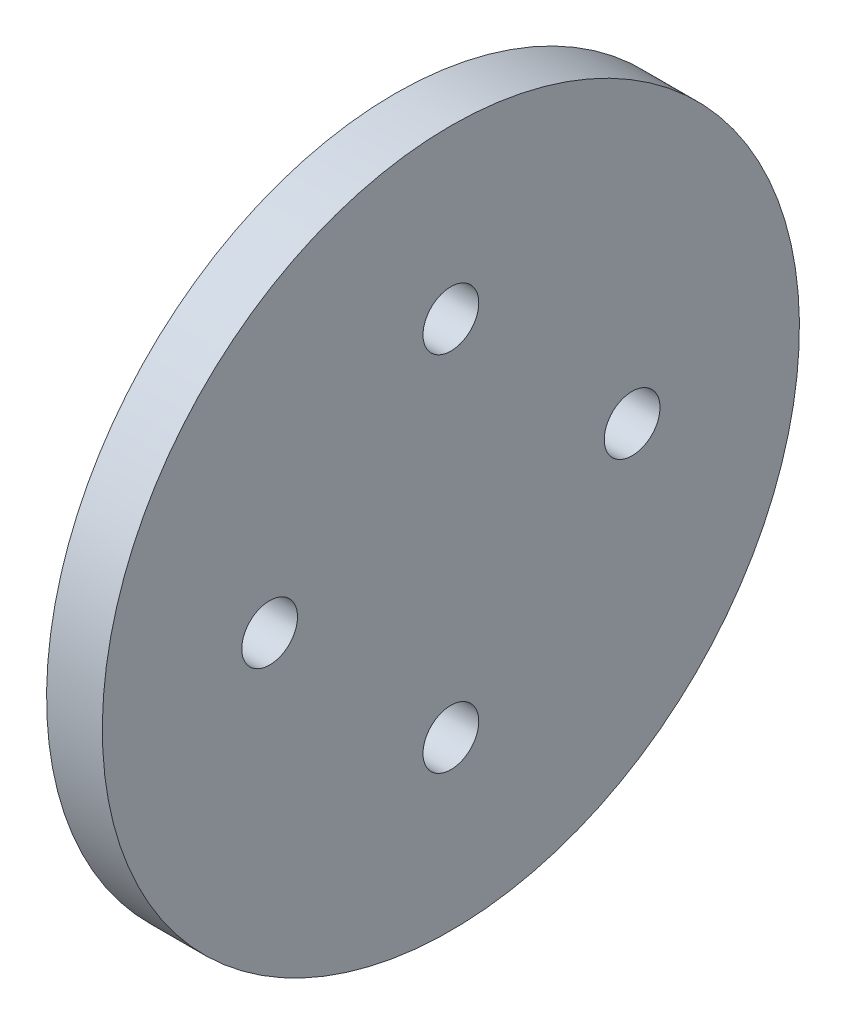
from build123d import *

# Parameters (mm, degrees)
ESQUISSE2_R             = 1
ENL_V_MAT_EXTRU_1_DEPTH = 19.371173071


with BuildPart() as part:
    # Esquisse1 → Base-R_volution (revolve)
    with BuildSketch(Plane.XY):
        Polygon((0, 0), (0, 12.5), (-2, 12.5), (-2, 3), (-4, 3), (-5, 2), (-5, 0), align=None)
    revolve(axis=Axis((0, 0, 0), (-1, 0, 0)))

    # Esquisse2 → Enl_v. mat.-Extru.1 (cut, through all)
    with BuildSketch(Plane(origin=(0, 0, 0), x_dir=(0, 0, -1), z_dir=(1, 0, 0))):
        with Locations(Location((-6.5, 0, 0), (0, 0, 90))):
            Circle(ESQUISSE2_R)
        with Locations(Location((0, 6.5, 0), (0, 0, 90))):
            Circle(ESQUISSE2_R)
        with Locations(Location((0, -6.5, 0), (0, 0, 90))):
            Circle(ESQUISSE2_R)
        with Locations(Location((6.5, 0, 0), (0, 0, 90))):
            Circle(ESQUISSE2_R)
    extrude(amount=-ENL_V_MAT_EXTRU_1_DEPTH, mode=Mode.SUBTRACT)


solid = part.part
